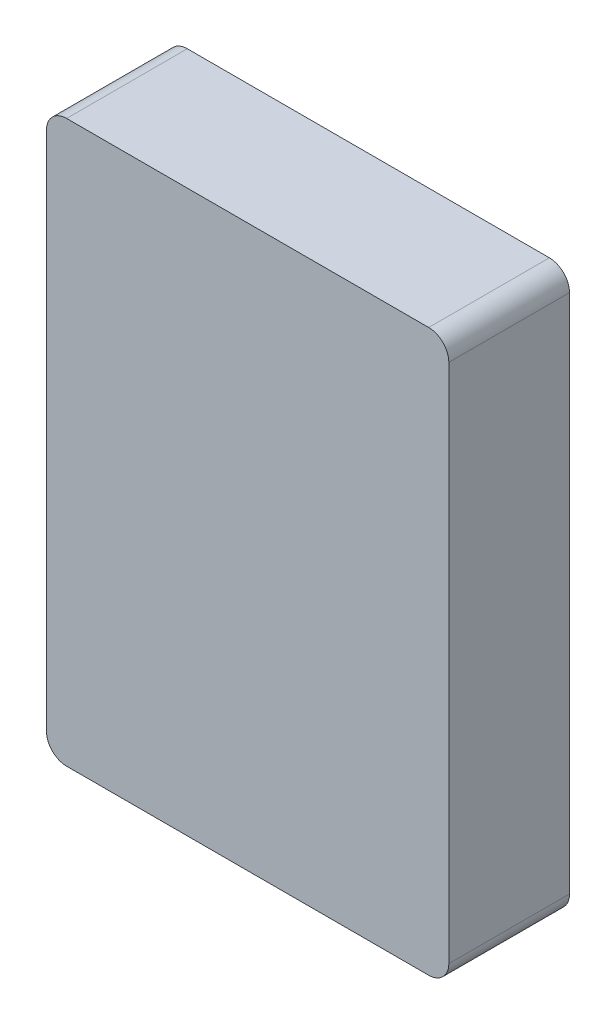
from build123d import *

# Parameters (mm, degrees)
SKETCH1_W           = 200
SKETCH1_H           = 278.88
BOSS_EXTRUDE1_DEPTH = 60
FILLET1_R           = 10


with BuildPart() as part:
    # Sketch1 → Boss-Extrude1 (new body)
    with BuildSketch(Plane.XY):
        with Locations((100, -139.44)):
            Rectangle(SKETCH1_W, SKETCH1_H)
    extrude(amount=BOSS_EXTRUDE1_DEPTH)

    # Fillet1
    fillet1_edges = [part.edges().sort_by_distance(p)[0] for p in [
        (0, 0, 30),
        (200, 0, 30),
        (200, -278.88, 30),
        (0, -278.88, 30),
    ]]
    fillet(fillet1_edges, radius=FILLET1_R)


solid = part.part
